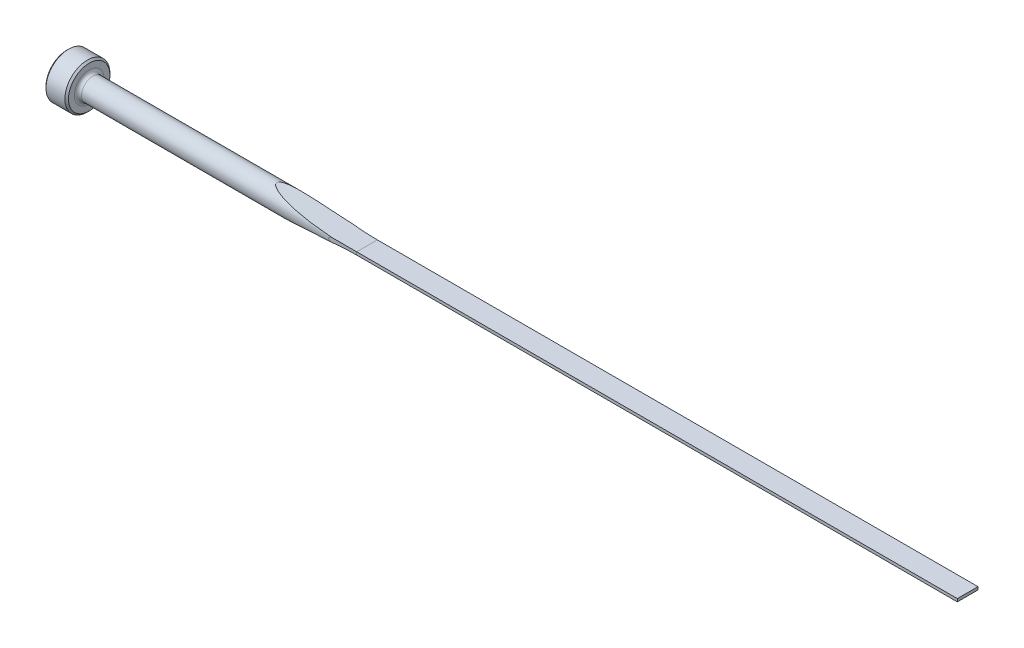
ISO-10303-21;
HEADER;
FILE_DESCRIPTION(('STEP AP214'),'2;1');
FILE_NAME('part.step','',(''),(''),'','','');
FILE_SCHEMA(('AUTOMOTIVE_DESIGN { 1 0 10303 214 1 1 1 1 }'));
ENDSEC;
DATA;
#1=APPLICATION_CONTEXT('core data for automotive mechanical design processes');
#2=APPLICATION_PROTOCOL_DEFINITION('international standard','automotive_design',2000,#1);
#3=PRODUCT_CONTEXT('',#1,'mechanical');
#4=PRODUCT('Part','Part','',(#3));
#5=PRODUCT_RELATED_PRODUCT_CATEGORY('part','',(#4));
#6=PRODUCT_DEFINITION_FORMATION('','',#4);
#7=PRODUCT_DEFINITION_CONTEXT('part definition',#1,'design');
#8=PRODUCT_DEFINITION('design','',#6,#7);
#9=PRODUCT_DEFINITION_SHAPE('','',#8);
#10=(LENGTH_UNIT() NAMED_UNIT(*) SI_UNIT(.MILLI.,.METRE.));
#11=(NAMED_UNIT(*) PLANE_ANGLE_UNIT() SI_UNIT($,.RADIAN.));
#12=(NAMED_UNIT(*) SI_UNIT($,.STERADIAN.) SOLID_ANGLE_UNIT());
#13=UNCERTAINTY_MEASURE_WITH_UNIT(LENGTH_MEASURE(1.E-05),#10,'distance_accuracy_value','');
#14=(GEOMETRIC_REPRESENTATION_CONTEXT(3) GLOBAL_UNCERTAINTY_ASSIGNED_CONTEXT((#13)) GLOBAL_UNIT_ASSIGNED_CONTEXT((#10,
#11,#12)) REPRESENTATION_CONTEXT('',''));
#15=CARTESIAN_POINT('',(0.,0.,0.));
#16=DIRECTION('',(0.,0.,1.));
#17=DIRECTION('',(1.,0.,0.));
#18=AXIS2_PLACEMENT_3D('',#15,#16,#17);
#19=CARTESIAN_POINT('',(0.,0.,0.));
#20=DIRECTION('',(-1.,0.,0.));
#21=DIRECTION('',(0.,0.,1.));
#22=AXIS2_PLACEMENT_3D('',#19,#20,#21);
#23=CYLINDRICAL_SURFACE('',#22,2.3749);
#24=CARTESIAN_POINT('',(5.5118,0.,0.));
#25=DIRECTION('',(-1.,0.,0.));
#26=DIRECTION('',(0.,0.,1.));
#27=AXIS2_PLACEMENT_3D('',#24,#25,#26);
#28=CIRCLE('',#27,2.3749);
#29=CARTESIAN_POINT('',(5.5118,0.,2.3749));
#30=VERTEX_POINT('',#29);
#31=EDGE_CURVE('E153',#30,#30,#28,.F.);
#32=ORIENTED_EDGE('',*,*,#31,.T.);
#33=EDGE_LOOP('',(#32));
#34=FACE_BOUND('',#33,.T.);
#35=CARTESIAN_POINT('',(63.5,0.931958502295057,2.18439999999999));
#36=CARTESIAN_POINT('',(63.3075515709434,0.931940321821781,2.18439976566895));
#37=CARTESIAN_POINT('',(63.1151013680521,0.930492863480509,2.18502490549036));
#38=CARTESIAN_POINT('',(62.7302234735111,0.92461137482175,2.18752450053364));
#39=CARTESIAN_POINT('',(62.5377957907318,0.920176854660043,2.18939916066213));
#40=CARTESIAN_POINT('',(62.1518341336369,0.908155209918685,2.19441218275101));
#41=CARTESIAN_POINT('',(61.9583008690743,0.900548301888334,2.19755847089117));
#42=CARTESIAN_POINT('',(61.5714442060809,0.881895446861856,2.20511052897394));
#43=CARTESIAN_POINT('',(61.3781207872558,0.870849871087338,2.20951616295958));
#44=CARTESIAN_POINT('',(60.9803005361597,0.844100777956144,2.21987943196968));
#45=CARTESIAN_POINT('',(60.7758212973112,0.828159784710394,2.2259136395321));
#46=CARTESIAN_POINT('',(60.3673129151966,0.791030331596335,2.23937732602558));
#47=CARTESIAN_POINT('',(60.1632839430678,0.769840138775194,2.24680726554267));
#48=CARTESIAN_POINT('',(59.75661740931,0.720830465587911,2.26301546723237));
#49=CARTESIAN_POINT('',(59.5539775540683,0.693029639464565,2.27178991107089));
#50=CARTESIAN_POINT('',(59.2512709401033,0.644172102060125,2.28592867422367));
#51=CARTESIAN_POINT('',(59.150603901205,0.626699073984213,2.29080303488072));
#52=CARTESIAN_POINT('',(58.9498678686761,0.588702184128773,2.30086330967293));
#53=CARTESIAN_POINT('',(58.8497987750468,0.568178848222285,2.30604917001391));
#54=CARTESIAN_POINT('',(58.7018199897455,0.534634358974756,2.31396676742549));
#55=CARTESIAN_POINT('',(58.6535509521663,0.523182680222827,2.3165891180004));
#56=CARTESIAN_POINT('',(58.5573085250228,0.499097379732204,2.32189592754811));
#57=CARTESIAN_POINT('',(58.5093351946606,0.486463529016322,2.32458039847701));
#58=CARTESIAN_POINT('',(58.3663526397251,0.446582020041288,2.33269738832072));
#59=CARTESIAN_POINT('',(58.2718724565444,0.417265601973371,2.33821536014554));
#60=CARTESIAN_POINT('',(58.1453639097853,0.370835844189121,2.34580058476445));
#61=CARTESIAN_POINT('',(58.1118331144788,0.357819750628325,2.34783049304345));
#62=CARTESIAN_POINT('',(58.0453758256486,0.330089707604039,2.35189084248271));
#63=CARTESIAN_POINT('',(58.01245087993,0.315371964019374,2.35392127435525));
#64=CARTESIAN_POINT('',(57.9466649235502,0.28318239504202,2.35801388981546));
#65=CARTESIAN_POINT('',(57.9138393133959,0.265637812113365,2.36007502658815));
#66=CARTESIAN_POINT('',(57.8503018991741,0.227094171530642,2.36409846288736));
#67=CARTESIAN_POINT('',(57.8195817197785,0.206110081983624,2.36606114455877));
#68=CARTESIAN_POINT('',(57.7807522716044,0.17363214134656,2.36855971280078));
#69=CARTESIAN_POINT('',(57.7706531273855,0.164553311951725,2.36921145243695));
#70=CARTESIAN_POINT('',(57.751335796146,0.145453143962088,2.3704611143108));
#71=CARTESIAN_POINT('',(57.7421190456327,0.135430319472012,2.3710589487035));
#72=CARTESIAN_POINT('',(57.7248924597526,0.114162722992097,2.372178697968));
#73=CARTESIAN_POINT('',(57.7168989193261,0.10290439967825,2.3726995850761));
#74=CARTESIAN_POINT('',(57.7029630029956,0.0791761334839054,2.37360916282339));
#75=CARTESIAN_POINT('',(57.6970130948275,0.0667108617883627,2.37399833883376));
#76=CARTESIAN_POINT('',(57.6895493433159,0.0451214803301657,2.37448695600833));
#77=CARTESIAN_POINT('',(57.687216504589,0.0362843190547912,2.37463982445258));
#78=CARTESIAN_POINT('',(57.684070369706,0.018342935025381,2.3748460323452));
#79=CARTESIAN_POINT('',(57.68325542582,0.00923901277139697,2.37489947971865));
#80=CARTESIAN_POINT('',(57.6832396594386,-0.00898512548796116,2.37490051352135));
#81=CARTESIAN_POINT('',(57.6840414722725,-0.0181053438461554,2.37484792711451));
#82=CARTESIAN_POINT('',(57.6871682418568,-0.0360804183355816,2.37464298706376));
#83=CARTESIAN_POINT('',(57.6894948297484,-0.0449349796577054,2.37449052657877));
#84=CARTESIAN_POINT('',(57.696426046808,-0.0650505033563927,2.37403676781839));
#85=CARTESIAN_POINT('',(57.7015301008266,-0.0761364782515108,2.37370288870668));
#86=CARTESIAN_POINT('',(57.7134090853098,-0.0973644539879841,2.37292722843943));
#87=CARTESIAN_POINT('',(57.720188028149,-0.10750410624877,2.37248518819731));
#88=CARTESIAN_POINT('',(57.7406526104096,-0.134467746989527,2.37115359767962));
#89=CARTESIAN_POINT('',(57.7555945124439,-0.150320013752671,2.37018436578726));
#90=CARTESIAN_POINT('',(57.7874630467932,-0.179846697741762,2.36812651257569));
#91=CARTESIAN_POINT('',(57.8043958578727,-0.193514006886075,2.36703752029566));
#92=CARTESIAN_POINT('',(57.8500057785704,-0.226993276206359,2.36411848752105));
#93=CARTESIAN_POINT('',(57.8796018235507,-0.245533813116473,2.36223795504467));
#94=CARTESIAN_POINT('',(57.9403493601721,-0.279898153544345,2.3584104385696));
#95=CARTESIAN_POINT('',(57.9715045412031,-0.295715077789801,2.35646330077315));
#96=CARTESIAN_POINT('',(58.0666093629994,-0.34041895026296,2.35057165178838));
#97=CARTESIAN_POINT('',(58.1319170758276,-0.366382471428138,2.34659497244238));
#98=CARTESIAN_POINT('',(58.2741782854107,-0.417382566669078,2.3380950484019));
#99=CARTESIAN_POINT('',(58.3513848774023,-0.441669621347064,2.33358126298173));
#100=CARTESIAN_POINT('',(58.506961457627,-0.486276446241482,2.32469268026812));
#101=CARTESIAN_POINT('',(58.5853319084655,-0.506594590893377,2.32031794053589));
#102=CARTESIAN_POINT('',(58.8218439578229,-0.563416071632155,2.30743335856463));
#103=CARTESIAN_POINT('',(58.9810064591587,-0.595665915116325,2.29918591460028));
#104=CARTESIAN_POINT('',(59.3005735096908,-0.653182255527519,2.28349651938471));
#105=CARTESIAN_POINT('',(59.46097818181,-0.678448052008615,2.27605464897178));
#106=CARTESIAN_POINT('',(59.7823165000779,-0.723854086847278,2.26202300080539));
#107=CARTESIAN_POINT('',(59.9432491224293,-0.744001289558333,2.25543207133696));
#108=CARTESIAN_POINT('',(60.3686966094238,-0.792003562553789,2.23917011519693));
#109=CARTESIAN_POINT('',(60.6336093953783,-0.816543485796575,2.23022625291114));
#110=CARTESIAN_POINT('',(61.1642384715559,-0.857758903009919,2.21469349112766));
#111=CARTESIAN_POINT('',(61.4299551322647,-0.874429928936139,2.20810593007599));
#112=CARTESIAN_POINT('',(61.9612705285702,-0.901186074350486,2.19732116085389));
#113=CARTESIAN_POINT('',(62.2268685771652,-0.911283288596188,2.19311956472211));
#114=CARTESIAN_POINT('',(62.7582486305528,-0.925643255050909,2.18709742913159));
#115=CARTESIAN_POINT('',(63.0240306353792,-0.929906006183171,2.18527689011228));
#116=CARTESIAN_POINT('',(63.3598826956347,-0.931763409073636,2.18448280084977));
#117=CARTESIAN_POINT('',(63.4299416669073,-0.931956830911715,2.18439997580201));
#118=CARTESIAN_POINT('',(63.5,-0.931958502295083,2.18439999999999));
#119=B_SPLINE_CURVE_WITH_KNOTS('',3,(#35,#36,#37,#38,#39,#40,#41,#42,#43,#44,#45,#46,#47,#48,
#49,#50,#51,#52,#53,#54,#55,#56,#57,#58,#59,#60,#61,#62,#63,#64,#65,#66,#67,#68,#69,#70,#71,#72,
#73,#74,#75,#76,#77,#78,#79,#80,#81,#82,#83,#84,#85,#86,#87,#88,#89,#90,#91,#92,#93,#94,#95,#96,
#97,#98,#99,#100,#101,#102,#103,#104,#105,#106,#107,#108,#109,#110,#111,#112,#113,#114,#115,
#116,#117,#118),.UNSPECIFIED.,.F.,.F.,(4,2,2,2,2,2,2,2,2,2,2,2,2,2,2,2,2,2,2,2,2,2,2,2,2,2,2,2,
2,2,2,2,2,2,2,2,2,2,2,2,2,4),(0.,0.577341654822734,1.15477801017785,1.73587049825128,
2.31690027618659,2.93240275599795,3.5481087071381,4.16209742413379,4.46893047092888,
4.77571068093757,4.9247288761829,5.07377599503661,5.37061535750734,5.47866452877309,
5.58695943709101,5.69870175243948,5.80997010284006,5.85071283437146,5.89152080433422,
5.93283229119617,5.97398983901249,6.00129967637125,6.02857985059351,6.05590452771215,
6.08325848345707,6.11967760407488,6.1561848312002,6.22123367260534,6.28649000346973,
6.39114062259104,6.49605180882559,6.70686384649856,6.94992813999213,7.19309177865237,
7.68061293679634,8.16818297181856,8.65508602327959,9.45349626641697,10.2523593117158,
11.0497483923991,11.8471376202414,12.0573140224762),.UNSPECIFIED.);
#120=CARTESIAN_POINT('',(58.3878429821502,0.451907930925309,2.33150793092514));
#121=VERTEX_POINT('',#120);
#122=CARTESIAN_POINT('',(58.3878429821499,-0.451907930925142,2.33150793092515));
#123=VERTEX_POINT('',#122);
#124=EDGE_CURVE('E156',#121,#123,#119,.T.);
#125=ORIENTED_EDGE('',*,*,#124,.F.);
#126=CARTESIAN_POINT('',(63.5,0.304800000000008,2.3552594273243));
#127=CARTESIAN_POINT('',(63.1043460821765,0.30479981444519,2.35523986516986));
#128=CARTESIAN_POINT('',(62.7086919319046,0.307441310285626,2.35491687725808));
#129=CARTESIAN_POINT('',(61.9174446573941,0.318006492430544,2.35352395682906));
#130=CARTESIAN_POINT('',(61.5218515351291,0.325930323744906,2.35245400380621));
#131=CARTESIAN_POINT('',(60.7301090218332,0.347077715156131,2.34942436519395));
#132=CARTESIAN_POINT('',(60.3339598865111,0.360310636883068,2.34746310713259));
#133=CARTESIAN_POINT('',(59.5418908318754,0.392073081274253,2.34236831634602));
#134=CARTESIAN_POINT('',(59.1459709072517,0.410602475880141,2.33923481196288));
#135=CARTESIAN_POINT('',(58.3536440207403,0.452995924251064,2.33139660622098));
#136=CARTESIAN_POINT('',(57.9572376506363,0.476870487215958,2.32668880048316));
#137=CARTESIAN_POINT('',(57.1648101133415,0.529927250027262,2.31518133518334));
#138=CARTESIAN_POINT('',(56.7687889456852,0.559109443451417,2.3083816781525));
#139=CARTESIAN_POINT('',(55.9771109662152,0.622782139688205,2.29202399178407));
#140=CARTESIAN_POINT('',(55.5814542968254,0.657274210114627,2.28246514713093));
#141=CARTESIAN_POINT('',(54.7907436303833,0.731546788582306,2.2597563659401));
#142=CARTESIAN_POINT('',(54.3956896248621,0.771327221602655,2.24660648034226));
#143=CARTESIAN_POINT('',(53.6065699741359,0.856130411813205,2.21567787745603));
#144=CARTESIAN_POINT('',(53.2125038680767,0.901149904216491,2.19790203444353));
#145=CARTESIAN_POINT('',(52.4253211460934,0.996417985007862,2.15638736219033));
#146=CARTESIAN_POINT('',(52.032204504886,1.04666643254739,2.13264869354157));
#147=CARTESIAN_POINT('',(51.2473997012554,1.15231293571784,2.07746885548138));
#148=CARTESIAN_POINT('',(50.8557109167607,1.20770837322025,2.04603158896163));
#149=CARTESIAN_POINT('',(50.0740456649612,1.32357457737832,1.97307361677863));
#150=CARTESIAN_POINT('',(49.6840689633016,1.38404462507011,1.93155433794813));
#151=CARTESIAN_POINT('',(49.0617780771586,1.48476947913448,1.85414726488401));
#152=CARTESIAN_POINT('',(48.8286677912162,1.52345842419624,1.82262717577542));
#153=CARTESIAN_POINT('',(48.3635793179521,1.60254888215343,1.75349899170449));
#154=CARTESIAN_POINT('',(48.1316013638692,1.64295073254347,1.71588969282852));
#155=CARTESIAN_POINT('',(47.6695574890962,1.72530469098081,1.63305871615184));
#156=CARTESIAN_POINT('',(47.4394896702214,1.76725495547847,1.58784587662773));
#157=CARTESIAN_POINT('',(46.981834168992,1.85255741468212,1.48746848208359));
#158=CARTESIAN_POINT('',(46.7542454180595,1.89590897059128,1.43230841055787));
#159=CARTESIAN_POINT('',(46.4156420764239,1.96176014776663,1.33905824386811));
#160=CARTESIAN_POINT('',(46.3031177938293,1.98387213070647,1.30618204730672));
#161=CARTESIAN_POINT('',(46.0793889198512,2.02828190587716,1.23610433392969));
#162=CARTESIAN_POINT('',(45.9681849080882,2.05057977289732,1.19890098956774));
#163=CARTESIAN_POINT('',(45.7474074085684,2.09528167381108,1.11894993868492));
#164=CARTESIAN_POINT('',(45.6378397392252,2.11768582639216,1.07618610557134));
#165=CARTESIAN_POINT('',(45.4217547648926,2.16228644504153,0.9835316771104));
#166=CARTESIAN_POINT('',(45.3152344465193,2.18448310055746,0.933648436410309));
#167=CARTESIAN_POINT('',(45.1586915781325,2.21739108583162,0.851003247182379));
#168=CARTESIAN_POINT('',(45.1067635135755,2.22835732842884,0.821963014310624));
#169=CARTESIAN_POINT('',(45.0047412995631,2.24999498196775,0.760743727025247));
#170=CARTESIAN_POINT('',(44.9546461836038,2.26066654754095,0.728566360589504));
#171=CARTESIAN_POINT('',(44.8573480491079,2.28147753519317,0.660507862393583));
#172=CARTESIAN_POINT('',(44.8101295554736,2.2916197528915,0.624649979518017));
#173=CARTESIAN_POINT('',(44.7196633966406,2.31112312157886,0.548106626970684));
#174=CARTESIAN_POINT('',(44.6764068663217,2.32048601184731,0.507432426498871));
#175=CARTESIAN_POINT('',(44.6062136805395,2.33572729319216,0.430865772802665));
#176=CARTESIAN_POINT('',(44.5778982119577,2.34189216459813,0.396313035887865));
#177=CARTESIAN_POINT('',(44.5265926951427,2.35308441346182,0.323266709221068));
#178=CARTESIAN_POINT('',(44.5035899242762,2.35811450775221,0.284782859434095));
#179=CARTESIAN_POINT('',(44.4711419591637,2.36521943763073,0.216084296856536));
#180=CARTESIAN_POINT('',(44.4597000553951,2.36772806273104,0.186869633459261));
#181=CARTESIAN_POINT('',(44.4416131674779,2.37169583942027,0.12691552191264));
#182=CARTESIAN_POINT('',(44.4349625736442,2.37315621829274,0.0961779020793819));
#183=CARTESIAN_POINT('',(44.427175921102,2.37486622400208,0.0337564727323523));
#184=CARTESIAN_POINT('',(44.4260753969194,2.37510804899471,0.00206786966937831));
#185=CARTESIAN_POINT('',(44.429632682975,2.37432670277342,-0.060971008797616));
#186=CARTESIAN_POINT('',(44.4342926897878,2.37330304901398,-0.0923211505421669));
#187=CARTESIAN_POINT('',(44.4482136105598,2.37024766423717,-0.151260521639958));
#188=CARTESIAN_POINT('',(44.4570801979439,2.36830234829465,-0.178950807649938));
#189=CARTESIAN_POINT('',(44.4784550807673,2.3636176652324,-0.232793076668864));
#190=CARTESIAN_POINT('',(44.4909645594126,2.36087804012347,-0.258944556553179));
#191=CARTESIAN_POINT('',(44.5297695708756,2.35239073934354,-0.329357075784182));
#192=CARTESIAN_POINT('',(44.559198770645,2.34596549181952,-0.371798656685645));
#193=CARTESIAN_POINT('',(44.6238677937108,2.33188857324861,-0.451779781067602));
#194=CARTESIAN_POINT('',(44.6591289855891,2.32423239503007,-0.489300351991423));
#195=CARTESIAN_POINT('',(44.7426941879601,2.30614793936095,-0.569123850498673));
#196=CARTESIAN_POINT('',(44.7920498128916,2.29550635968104,-0.610261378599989));
#197=CARTESIAN_POINT('',(44.8943955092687,2.27353842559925,-0.687594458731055));
#198=CARTESIAN_POINT('',(44.947392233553,2.26221082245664,-0.723780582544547));
#199=CARTESIAN_POINT('',(45.0560143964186,2.23910277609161,-0.792390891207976));
#200=CARTESIAN_POINT('',(45.1116512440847,2.22732041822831,-0.824796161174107));
#201=CARTESIAN_POINT('',(45.2245432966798,2.20352981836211,-0.886392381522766));
#202=CARTESIAN_POINT('',(45.281797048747,2.19152178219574,-0.915586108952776));
#203=CARTESIAN_POINT('',(45.439316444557,2.15865100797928,-0.991529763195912));
#204=CARTESIAN_POINT('',(45.5407803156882,2.13765710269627,-1.03573028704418));
#205=CARTESIAN_POINT('',(45.7460136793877,2.09557562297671,-1.11841472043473));
#206=CARTESIAN_POINT('',(45.8497845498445,2.07448799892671,-1.15689510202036));
#207=CARTESIAN_POINT('',(46.0591070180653,2.03234636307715,-1.22942247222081));
#208=CARTESIAN_POINT('',(46.1646618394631,2.01129250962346,-1.26346017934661));
#209=CARTESIAN_POINT('',(46.3769205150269,1.96936077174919,-1.3278714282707));
#210=CARTESIAN_POINT('',(46.4836244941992,1.9484829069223,-1.35824456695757));
#211=CARTESIAN_POINT('',(46.6981321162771,1.90692374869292,-1.41600119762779));
#212=CARTESIAN_POINT('',(46.8059376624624,1.88624298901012,-1.4433779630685));
#213=CARTESIAN_POINT('',(47.0222331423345,1.84516790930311,-1.49552876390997));
#214=CARTESIAN_POINT('',(47.1307231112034,1.82477360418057,-1.52030266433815));
#215=CARTESIAN_POINT('',(47.3480985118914,1.78433166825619,-1.56757025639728));
#216=CARTESIAN_POINT('',(47.4569831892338,1.76428359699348,-1.5900670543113));
#217=CARTESIAN_POINT('',(47.675196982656,1.72452844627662,-1.63309762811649));
#218=CARTESIAN_POINT('',(47.7845260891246,1.70482135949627,-1.65363144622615));
#219=CARTESIAN_POINT('',(48.1111425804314,1.64658117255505,-1.71229386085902));
#220=CARTESIAN_POINT('',(48.3289797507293,1.60857175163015,-1.7478914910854));
#221=CARTESIAN_POINT('',(48.7657364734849,1.53404903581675,-1.81364394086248));
#222=CARTESIAN_POINT('',(48.9846561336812,1.49753589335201,-1.84379820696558));
#223=CARTESIAN_POINT('',(49.4233891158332,1.42605291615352,-1.89962649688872));
#224=CARTESIAN_POINT('',(49.6432027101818,1.39108359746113,-1.92529903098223));
#225=CARTESIAN_POINT('',(50.0834870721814,1.32273799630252,-1.97287649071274));
#226=CARTESIAN_POINT('',(50.3039578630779,1.28936177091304,-1.99478128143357));
#227=CARTESIAN_POINT('',(50.9669325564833,1.19155095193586,-2.05579768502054));
#228=CARTESIAN_POINT('',(51.4102407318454,1.12955778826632,-2.09011926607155));
#229=CARTESIAN_POINT('',(52.2982476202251,1.01221904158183,-2.1493844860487));
#230=CARTESIAN_POINT('',(52.7429460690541,0.956872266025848,-2.17432980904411));
#231=CARTESIAN_POINT('',(53.6332648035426,0.852899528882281,-2.21717632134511));
#232=CARTESIAN_POINT('',(54.0788846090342,0.804270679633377,-2.23508054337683));
#233=CARTESIAN_POINT('',(54.9710014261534,0.713742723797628,-2.26561221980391));
#234=CARTESIAN_POINT('',(55.417498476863,0.671843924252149,-2.27823943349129));
#235=CARTESIAN_POINT('',(56.3107886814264,0.5948341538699,-2.29954678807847));
#236=CARTESIAN_POINT('',(56.7575812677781,0.559717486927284,-2.30823024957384));
#237=CARTESIAN_POINT('',(57.6516796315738,0.496243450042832,-2.32270340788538));
#238=CARTESIAN_POINT('',(58.0989853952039,0.467885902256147,-2.32849318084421));
#239=CARTESIAN_POINT('',(58.9592742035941,0.4198759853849,-2.33760615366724));
#240=CARTESIAN_POINT('',(59.3722275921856,0.399718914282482,-2.34108587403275));
#241=CARTESIAN_POINT('',(60.1984402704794,0.365165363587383,-2.34672300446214));
#242=CARTESIAN_POINT('',(60.6116995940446,0.350769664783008,-2.34888023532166));
#243=CARTESIAN_POINT('',(61.4374541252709,0.327771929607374,-2.35220275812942));
#244=CARTESIAN_POINT('',(61.849948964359,0.319156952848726,-2.35337026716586));
#245=CARTESIAN_POINT('',(62.6749626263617,0.307671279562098,-2.35488699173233));
#246=CARTESIAN_POINT('',(63.0874814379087,0.30479978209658,-2.35523632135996));
#247=CARTESIAN_POINT('',(63.5,0.304799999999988,-2.3552594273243));
#248=B_SPLINE_CURVE_WITH_KNOTS('',3,(#126,#127,#128,#129,#130,#131,#132,#133,#134,#135,#136,
#137,#138,#139,#140,#141,#142,#143,#144,#145,#146,#147,#148,#149,#150,#151,#152,#153,#154,#155,
#156,#157,#158,#159,#160,#161,#162,#163,#164,#165,#166,#167,#168,#169,#170,#171,#172,#173,#174,
#175,#176,#177,#178,#179,#180,#181,#182,#183,#184,#185,#186,#187,#188,#189,#190,#191,#192,#193,
#194,#195,#196,#197,#198,#199,#200,#201,#202,#203,#204,#205,#206,#207,#208,#209,#210,#211,#212,
#213,#214,#215,#216,#217,#218,#219,#220,#221,#222,#223,#224,#225,#226,#227,#228,#229,#230,#231,
#232,#233,#234,#235,#236,#237,#238,#239,#240,#241,#242,#243,#244,#245,#246,#247),.UNSPECIFIED.,
.F.,.F.,(4,2,2,2,2,2,2,2,2,2,2,2,2,2,2,2,2,2,2,2,2,2,2,2,2,2,2,2,2,2,2,2,2,2,2,2,2,2,2,2,2,2,2,
2,2,2,2,2,2,2,2,2,2,2,2,2,2,2,2,2,4),(0.,1.18695317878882,2.37393894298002,3.56302700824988,
4.75208632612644,5.94350432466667,7.1349208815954,8.32668985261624,9.51844191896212,
10.7094552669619,11.9004365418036,13.0908152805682,14.2810256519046,14.9961362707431,
15.7113884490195,16.4258149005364,17.1399201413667,17.4977450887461,17.855721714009,
18.2147607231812,18.5734314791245,18.7548483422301,18.9361681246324,19.1164058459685,
19.2962298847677,19.4311787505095,19.5658010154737,19.6598804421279,19.7538495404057,
19.8484195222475,19.9430255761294,20.0301263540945,20.1172554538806,20.2724769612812,
20.4282803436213,20.6232118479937,20.8185095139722,21.0147457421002,21.2108109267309,
21.5484890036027,21.8863744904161,22.2249549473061,22.5635726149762,22.9029354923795,
23.2423159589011,23.5812270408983,23.9201308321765,24.5919541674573,25.2638457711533,
25.9359602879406,26.6080988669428,27.9546954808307,29.3010501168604,30.6468242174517,
31.9926596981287,33.3373598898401,34.6820246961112,35.9223614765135,37.1628662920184,
38.4005848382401,39.6381307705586),.UNSPECIFIED.);
#249=CARTESIAN_POINT('',(58.3878429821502,0.451907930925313,-2.33150793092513));
#250=VERTEX_POINT('',#249);
#251=EDGE_CURVE('E106',#121,#250,#248,.T.);
#252=ORIENTED_EDGE('',*,*,#251,.T.);
#253=CARTESIAN_POINT('',(63.5,0.931958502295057,-2.18439999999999));
#254=CARTESIAN_POINT('',(63.3075515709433,0.931940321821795,-2.18439976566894));
#255=CARTESIAN_POINT('',(63.115101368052,0.930492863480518,-2.18502490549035));
#256=CARTESIAN_POINT('',(62.7302234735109,0.924611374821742,-2.18752450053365));
#257=CARTESIAN_POINT('',(62.5377957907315,0.920176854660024,-2.18939916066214));
#258=CARTESIAN_POINT('',(62.1518341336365,0.908155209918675,-2.19441218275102));
#259=CARTESIAN_POINT('',(61.9583008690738,0.900548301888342,-2.19755847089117));
#260=CARTESIAN_POINT('',(61.5714442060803,0.881895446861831,-2.20511052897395));
#261=CARTESIAN_POINT('',(61.3781207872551,0.870849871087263,-2.20951616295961));
#262=CARTESIAN_POINT('',(60.980300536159,0.844100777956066,-2.21987943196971));
#263=CARTESIAN_POINT('',(60.7758212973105,0.828159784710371,-2.22591363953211));
#264=CARTESIAN_POINT('',(60.3673129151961,0.791030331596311,-2.23937732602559));
#265=CARTESIAN_POINT('',(60.1632839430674,0.769840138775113,-2.2468072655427));
#266=CARTESIAN_POINT('',(59.7566174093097,0.720830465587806,-2.26301546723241));
#267=CARTESIAN_POINT('',(59.5539775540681,0.693029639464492,-2.27178991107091));
#268=CARTESIAN_POINT('',(59.2512709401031,0.644172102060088,-2.28592867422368));
#269=CARTESIAN_POINT('',(59.1506039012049,0.626699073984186,-2.29080303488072));
#270=CARTESIAN_POINT('',(58.949867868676,0.588702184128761,-2.30086330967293));
#271=CARTESIAN_POINT('',(58.8497987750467,0.568178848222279,-2.30604917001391));
#272=CARTESIAN_POINT('',(58.7018199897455,0.534634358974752,-2.31396676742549));
#273=CARTESIAN_POINT('',(58.6535509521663,0.523182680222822,-2.31658911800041));
#274=CARTESIAN_POINT('',(58.5573085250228,0.499097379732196,-2.32189592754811));
#275=CARTESIAN_POINT('',(58.5093351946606,0.486463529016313,-2.32458039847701));
#276=CARTESIAN_POINT('',(58.3663526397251,0.446582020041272,-2.33269738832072));
#277=CARTESIAN_POINT('',(58.2718724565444,0.417265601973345,-2.33821536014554));
#278=CARTESIAN_POINT('',(58.1453639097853,0.370835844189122,-2.34580058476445));
#279=CARTESIAN_POINT('',(58.1118331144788,0.357819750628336,-2.34783049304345));
#280=CARTESIAN_POINT('',(58.0453758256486,0.330089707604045,-2.35189084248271));
#281=CARTESIAN_POINT('',(58.01245087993,0.315371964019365,-2.35392127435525));
#282=CARTESIAN_POINT('',(57.9466649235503,0.28318239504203,-2.35801388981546));
#283=CARTESIAN_POINT('',(57.9138393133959,0.265637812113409,-2.36007502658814));
#284=CARTESIAN_POINT('',(57.8503018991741,0.227094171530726,-2.36409846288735));
#285=CARTESIAN_POINT('',(57.8195817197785,0.206110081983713,-2.36606114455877));
#286=CARTESIAN_POINT('',(57.7807522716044,0.173632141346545,-2.36855971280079));
#287=CARTESIAN_POINT('',(57.7706531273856,0.164553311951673,-2.36921145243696));
#288=CARTESIAN_POINT('',(57.751335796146,0.145453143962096,-2.3704611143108));
#289=CARTESIAN_POINT('',(57.7421190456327,0.135430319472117,-2.37105894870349));
#290=CARTESIAN_POINT('',(57.7248924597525,0.114162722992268,-2.37217869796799));
#291=CARTESIAN_POINT('',(57.716898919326,0.102904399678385,-2.37269958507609));
#292=CARTESIAN_POINT('',(57.7029630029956,0.0791761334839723,-2.37360916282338));
#293=CARTESIAN_POINT('',(57.6970130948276,0.0667108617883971,-2.37399833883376));
#294=CARTESIAN_POINT('',(57.6895493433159,0.0451214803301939,-2.37448695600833));
#295=CARTESIAN_POINT('',(57.6872165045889,0.0362843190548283,-2.37463982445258));
#296=CARTESIAN_POINT('',(57.684070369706,0.0183429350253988,-2.3748460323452));
#297=CARTESIAN_POINT('',(57.6832554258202,0.00923901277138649,-2.37489947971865));
#298=CARTESIAN_POINT('',(57.6832396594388,-0.00898512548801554,-2.37490051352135));
#299=CARTESIAN_POINT('',(57.6840414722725,-0.0181053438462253,-2.37484792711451));
#300=CARTESIAN_POINT('',(57.6871682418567,-0.0360804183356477,-2.37464298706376));
#301=CARTESIAN_POINT('',(57.6894948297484,-0.0449349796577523,-2.37449052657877));
#302=CARTESIAN_POINT('',(57.6964260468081,-0.0650505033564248,-2.37403676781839));
#303=CARTESIAN_POINT('',(57.7015301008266,-0.0761364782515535,-2.37370288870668));
#304=CARTESIAN_POINT('',(57.7134090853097,-0.0973644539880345,-2.37292722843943));
#305=CARTESIAN_POINT('',(57.720188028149,-0.107504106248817,-2.3724851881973));
#306=CARTESIAN_POINT('',(57.7406526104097,-0.134467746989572,-2.37115359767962));
#307=CARTESIAN_POINT('',(57.755594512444,-0.15032001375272,-2.37018436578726));
#308=CARTESIAN_POINT('',(57.7874630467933,-0.179846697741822,-2.36812651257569));
#309=CARTESIAN_POINT('',(57.8043958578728,-0.193514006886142,-2.36703752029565));
#310=CARTESIAN_POINT('',(57.8500057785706,-0.226993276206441,-2.36411848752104));
#311=CARTESIAN_POINT('',(57.8796018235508,-0.245533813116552,-2.36223795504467));
#312=CARTESIAN_POINT('',(57.9403493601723,-0.279898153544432,-2.35841043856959));
#313=CARTESIAN_POINT('',(57.9715045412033,-0.295715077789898,-2.35646330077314));
#314=CARTESIAN_POINT('',(58.0666093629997,-0.340418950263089,-2.35057165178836));
#315=CARTESIAN_POINT('',(58.1319170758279,-0.36638247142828,-2.34659497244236));
#316=CARTESIAN_POINT('',(58.2741782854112,-0.41738256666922,-2.33809504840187));
#317=CARTESIAN_POINT('',(58.3513848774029,-0.441669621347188,-2.33358126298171));
#318=CARTESIAN_POINT('',(58.5069614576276,-0.486276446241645,-2.32469268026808));
#319=CARTESIAN_POINT('',(58.5853319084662,-0.506594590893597,-2.32031794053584));
#320=CARTESIAN_POINT('',(58.8218439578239,-0.563416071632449,-2.30743335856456));
#321=CARTESIAN_POINT('',(58.9810064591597,-0.595665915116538,-2.29918591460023));
#322=CARTESIAN_POINT('',(59.3005735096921,-0.653182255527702,-2.28349651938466));
#323=CARTESIAN_POINT('',(59.4609781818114,-0.678448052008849,-2.27605464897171));
#324=CARTESIAN_POINT('',(59.7823165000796,-0.723854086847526,-2.26202300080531));
#325=CARTESIAN_POINT('',(59.9432491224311,-0.744001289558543,-2.25543207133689));
#326=CARTESIAN_POINT('',(60.3686966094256,-0.792003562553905,-2.23917011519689));
#327=CARTESIAN_POINT('',(60.6336093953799,-0.816543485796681,-2.2302262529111));
#328=CARTESIAN_POINT('',(61.1642384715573,-0.857758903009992,-2.21469349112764));
#329=CARTESIAN_POINT('',(61.4299551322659,-0.874429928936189,-2.20810593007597));
#330=CARTESIAN_POINT('',(61.9612705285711,-0.901186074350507,-2.19732116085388));
#331=CARTESIAN_POINT('',(62.226868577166,-0.911283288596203,-2.1931195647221));
#332=CARTESIAN_POINT('',(62.7582486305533,-0.925643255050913,-2.18709742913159));
#333=CARTESIAN_POINT('',(63.0240306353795,-0.929906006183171,-2.18527689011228));
#334=CARTESIAN_POINT('',(63.3598826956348,-0.931763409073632,-2.18448280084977));
#335=CARTESIAN_POINT('',(63.4299416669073,-0.931956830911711,-2.18439997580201));
#336=CARTESIAN_POINT('',(63.5,-0.931958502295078,-2.18439999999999));
#337=B_SPLINE_CURVE_WITH_KNOTS('',3,(#253,#254,#255,#256,#257,#258,#259,#260,#261,#262,#263,
#264,#265,#266,#267,#268,#269,#270,#271,#272,#273,#274,#275,#276,#277,#278,#279,#280,#281,#282,
#283,#284,#285,#286,#287,#288,#289,#290,#291,#292,#293,#294,#295,#296,#297,#298,#299,#300,#301,
#302,#303,#304,#305,#306,#307,#308,#309,#310,#311,#312,#313,#314,#315,#316,#317,#318,#319,#320,
#321,#322,#323,#324,#325,#326,#327,#328,#329,#330,#331,#332,#333,#334,#335,#336),.UNSPECIFIED.,
.F.,.F.,(4,2,2,2,2,2,2,2,2,2,2,2,2,2,2,2,2,2,2,2,2,2,2,2,2,2,2,2,2,2,2,2,2,2,2,2,2,2,2,2,2,4),
(0.,0.577341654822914,1.15477801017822,1.73587049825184,2.31690027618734,2.9324027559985,
3.54810870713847,4.16209742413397,4.46893047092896,4.77571068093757,4.92472887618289,
5.0737759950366,5.37061535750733,5.47866452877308,5.58695943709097,5.69870175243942,
5.80997010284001,5.85071283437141,5.89152080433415,5.93283229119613,5.97398983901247,
6.00129967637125,6.02857985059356,6.05590452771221,6.08325848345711,6.11967760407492,
6.15618483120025,6.22123367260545,6.28649000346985,6.39114062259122,6.49605180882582,
6.70686384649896,6.94992813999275,7.19309177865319,7.68061293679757,8.16818297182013,
8.65508602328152,9.45349626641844,10.2523593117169,11.0497483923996,11.8471376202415,
12.0573140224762),.UNSPECIFIED.);
#338=CARTESIAN_POINT('',(58.3878429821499,-0.451907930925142,-2.33150793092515));
#339=VERTEX_POINT('',#338);
#340=EDGE_CURVE('E175',#250,#339,#337,.T.);
#341=ORIENTED_EDGE('',*,*,#340,.T.);
#342=CARTESIAN_POINT('',(63.5,-0.304800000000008,2.3552594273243));
#343=CARTESIAN_POINT('',(63.1043460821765,-0.304799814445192,2.35523986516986));
#344=CARTESIAN_POINT('',(62.7086919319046,-0.307441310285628,2.35491687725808));
#345=CARTESIAN_POINT('',(61.9174446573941,-0.318006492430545,2.35352395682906));
#346=CARTESIAN_POINT('',(61.5218515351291,-0.325930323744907,2.35245400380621));
#347=CARTESIAN_POINT('',(60.7301090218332,-0.347077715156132,2.34942436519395));
#348=CARTESIAN_POINT('',(60.3339598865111,-0.360310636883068,2.34746310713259));
#349=CARTESIAN_POINT('',(59.5418908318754,-0.392073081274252,2.34236831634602));
#350=CARTESIAN_POINT('',(59.1459709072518,-0.410602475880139,2.33923481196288));
#351=CARTESIAN_POINT('',(58.3536440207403,-0.452995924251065,2.33139660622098));
#352=CARTESIAN_POINT('',(57.9572376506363,-0.476870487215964,2.32668880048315));
#353=CARTESIAN_POINT('',(57.1648101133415,-0.529927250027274,2.31518133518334));
#354=CARTESIAN_POINT('',(56.7687889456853,-0.559109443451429,2.30838167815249));
#355=CARTESIAN_POINT('',(55.9771109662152,-0.622782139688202,2.29202399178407));
#356=CARTESIAN_POINT('',(55.5814542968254,-0.657274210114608,2.28246514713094));
#357=CARTESIAN_POINT('',(54.7907436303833,-0.731546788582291,2.25975636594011));
#358=CARTESIAN_POINT('',(54.3956896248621,-0.771327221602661,2.24660648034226));
#359=CARTESIAN_POINT('',(53.606569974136,-0.856130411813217,2.21567787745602));
#360=CARTESIAN_POINT('',(53.2125038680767,-0.901149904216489,2.19790203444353));
#361=CARTESIAN_POINT('',(52.4253211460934,-0.996417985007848,2.15638736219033));
#362=CARTESIAN_POINT('',(52.032204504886,-1.04666643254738,2.13264869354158));
#363=CARTESIAN_POINT('',(51.2473997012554,-1.15231293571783,2.07746885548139));
#364=CARTESIAN_POINT('',(50.8557109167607,-1.20770837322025,2.04603158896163));
#365=CARTESIAN_POINT('',(50.0740456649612,-1.32357457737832,1.97307361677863));
#366=CARTESIAN_POINT('',(49.6840689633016,-1.38404462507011,1.93155433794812));
#367=CARTESIAN_POINT('',(49.0617780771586,-1.48476947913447,1.85414726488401));
#368=CARTESIAN_POINT('',(48.8286677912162,-1.52345842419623,1.82262717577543));
#369=CARTESIAN_POINT('',(48.3635793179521,-1.60254888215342,1.7534989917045));
#370=CARTESIAN_POINT('',(48.1316013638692,-1.64295073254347,1.71588969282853));
#371=CARTESIAN_POINT('',(47.6695574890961,-1.72530469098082,1.63305871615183));
#372=CARTESIAN_POINT('',(47.4394896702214,-1.76725495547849,1.58784587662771));
#373=CARTESIAN_POINT('',(46.981834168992,-1.85255741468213,1.48746848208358));
#374=CARTESIAN_POINT('',(46.7542454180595,-1.89590897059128,1.43230841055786));
#375=CARTESIAN_POINT('',(46.4156420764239,-1.96176014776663,1.3390582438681));
#376=CARTESIAN_POINT('',(46.3031177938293,-1.98387213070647,1.3061820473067));
#377=CARTESIAN_POINT('',(46.0793889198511,-2.02828190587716,1.23610433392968));
#378=CARTESIAN_POINT('',(45.9681849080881,-2.05057977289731,1.19890098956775));
#379=CARTESIAN_POINT('',(45.7474074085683,-2.09528167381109,1.11894993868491));
#380=CARTESIAN_POINT('',(45.6378397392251,-2.11768582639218,1.0761861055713));
#381=CARTESIAN_POINT('',(45.4217547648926,-2.16228644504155,0.983531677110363));
#382=CARTESIAN_POINT('',(45.3152344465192,-2.18448310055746,0.933648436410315));
#383=CARTESIAN_POINT('',(45.1586915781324,-2.21739108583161,0.8510032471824));
#384=CARTESIAN_POINT('',(45.1067635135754,-2.22835732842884,0.821963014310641));
#385=CARTESIAN_POINT('',(45.004741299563,-2.24999498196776,0.760743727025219));
#386=CARTESIAN_POINT('',(44.9546461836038,-2.26066654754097,0.728566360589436));
#387=CARTESIAN_POINT('',(44.8573480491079,-2.28147753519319,0.660507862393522));
#388=CARTESIAN_POINT('',(44.8101295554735,-2.2916197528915,0.624649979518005));
#389=CARTESIAN_POINT('',(44.7196633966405,-2.31112312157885,0.548106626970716));
#390=CARTESIAN_POINT('',(44.6764068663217,-2.32048601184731,0.5074324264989));
#391=CARTESIAN_POINT('',(44.6062136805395,-2.33572729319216,0.43086577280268));
#392=CARTESIAN_POINT('',(44.5778982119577,-2.34189216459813,0.396313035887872));
#393=CARTESIAN_POINT('',(44.5265926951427,-2.35308441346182,0.323266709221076));
#394=CARTESIAN_POINT('',(44.5035899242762,-2.35811450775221,0.284782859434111));
#395=CARTESIAN_POINT('',(44.4711419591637,-2.36521943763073,0.216084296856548));
#396=CARTESIAN_POINT('',(44.4597000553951,-2.36772806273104,0.186869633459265));
#397=CARTESIAN_POINT('',(44.4416131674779,-2.37169583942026,0.126915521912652));
#398=CARTESIAN_POINT('',(44.4349625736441,-2.37315621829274,0.0961779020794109));
#399=CARTESIAN_POINT('',(44.4271759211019,-2.37486622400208,0.0337564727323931));
#400=CARTESIAN_POINT('',(44.4260753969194,-2.37510804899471,0.00206786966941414));
#401=CARTESIAN_POINT('',(44.429632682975,-2.37432670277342,-0.0609710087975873));
#402=CARTESIAN_POINT('',(44.4342926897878,-2.37330304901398,-0.0923211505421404));
#403=CARTESIAN_POINT('',(44.4482136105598,-2.37024766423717,-0.151260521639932));
#404=CARTESIAN_POINT('',(44.4570801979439,-2.36830234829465,-0.178950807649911));
#405=CARTESIAN_POINT('',(44.4784550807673,-2.3636176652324,-0.232793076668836));
#406=CARTESIAN_POINT('',(44.4909645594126,-2.36087804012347,-0.258944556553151));
#407=CARTESIAN_POINT('',(44.5297695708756,-2.35239073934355,-0.329357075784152));
#408=CARTESIAN_POINT('',(44.559198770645,-2.34596549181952,-0.371798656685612));
#409=CARTESIAN_POINT('',(44.6238677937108,-2.33188857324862,-0.451779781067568));
#410=CARTESIAN_POINT('',(44.6591289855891,-2.32423239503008,-0.489300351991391));
#411=CARTESIAN_POINT('',(44.7426941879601,-2.30614793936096,-0.569123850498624));
#412=CARTESIAN_POINT('',(44.7920498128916,-2.29550635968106,-0.610261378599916));
#413=CARTESIAN_POINT('',(44.8943955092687,-2.27353842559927,-0.687594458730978));
#414=CARTESIAN_POINT('',(44.947392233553,-2.26221082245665,-0.72378058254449));
#415=CARTESIAN_POINT('',(45.0560143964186,-2.23910277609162,-0.792390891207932));
#416=CARTESIAN_POINT('',(45.1116512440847,-2.22732041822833,-0.824796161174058));
#417=CARTESIAN_POINT('',(45.2245432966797,-2.20352981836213,-0.886392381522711));
#418=CARTESIAN_POINT('',(45.2817970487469,-2.19152178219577,-0.915586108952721));
#419=CARTESIAN_POINT('',(45.4393164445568,-2.1586510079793,-0.991529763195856));
#420=CARTESIAN_POINT('',(45.540780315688,-2.1376571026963,-1.03573028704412));
#421=CARTESIAN_POINT('',(45.7460136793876,-2.09557562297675,-1.11841472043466));
#422=CARTESIAN_POINT('',(45.8497845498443,-2.07448799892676,-1.15689510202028));
#423=CARTESIAN_POINT('',(46.0591070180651,-2.0323463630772,-1.22942247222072));
#424=CARTESIAN_POINT('',(46.1646618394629,-2.01129250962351,-1.26346017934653));
#425=CARTESIAN_POINT('',(46.3769205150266,-1.96936077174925,-1.32787142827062));
#426=CARTESIAN_POINT('',(46.483624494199,-1.94848290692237,-1.35824456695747));
#427=CARTESIAN_POINT('',(46.6981321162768,-1.906923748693,-1.41600119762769));
#428=CARTESIAN_POINT('',(46.805937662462,-1.88624298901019,-1.44337796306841));
#429=CARTESIAN_POINT('',(47.0222331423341,-1.84516790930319,-1.49552876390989));
#430=CARTESIAN_POINT('',(47.130723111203,-1.82477360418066,-1.52030266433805));
#431=CARTESIAN_POINT('',(47.348098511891,-1.78433166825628,-1.56757025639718));
#432=CARTESIAN_POINT('',(47.4569831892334,-1.76428359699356,-1.59006705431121));
#433=CARTESIAN_POINT('',(47.6751969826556,-1.7245284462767,-1.63309762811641));
#434=CARTESIAN_POINT('',(47.7845260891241,-1.70482135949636,-1.65363144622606));
#435=CARTESIAN_POINT('',(48.1111425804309,-1.64658117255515,-1.71229386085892));
#436=CARTESIAN_POINT('',(48.3289797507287,-1.60857175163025,-1.7478914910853));
#437=CARTESIAN_POINT('',(48.7657364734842,-1.53404903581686,-1.81364394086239));
#438=CARTESIAN_POINT('',(48.9846561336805,-1.49753589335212,-1.8437982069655));
#439=CARTESIAN_POINT('',(49.4233891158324,-1.42605291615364,-1.89962649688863));
#440=CARTESIAN_POINT('',(49.643202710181,-1.39108359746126,-1.92529903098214));
#441=CARTESIAN_POINT('',(50.0834870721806,-1.32273799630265,-1.97287649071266));
#442=CARTESIAN_POINT('',(50.303957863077,-1.28936177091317,-1.99478128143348));
#443=CARTESIAN_POINT('',(50.9669325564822,-1.19155095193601,-2.05579768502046));
#444=CARTESIAN_POINT('',(51.4102407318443,-1.12955778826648,-2.09011926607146));
#445=CARTESIAN_POINT('',(52.2982476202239,-1.01221904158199,-2.14938448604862));
#446=CARTESIAN_POINT('',(52.7429460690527,-0.956872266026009,-2.17432980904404));
#447=CARTESIAN_POINT('',(53.6332648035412,-0.852899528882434,-2.21717632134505));
#448=CARTESIAN_POINT('',(54.0788846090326,-0.804270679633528,-2.23508054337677));
#449=CARTESIAN_POINT('',(54.9710014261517,-0.713742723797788,-2.26561221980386));
#450=CARTESIAN_POINT('',(55.4174984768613,-0.67184392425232,-2.27823943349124));
#451=CARTESIAN_POINT('',(56.3107886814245,-0.594834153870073,-2.29954678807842));
#452=CARTESIAN_POINT('',(56.7575812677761,-0.559717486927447,-2.3082302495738));
#453=CARTESIAN_POINT('',(57.6516796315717,-0.496243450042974,-2.32270340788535));
#454=CARTESIAN_POINT('',(58.0989853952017,-0.467885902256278,-2.32849318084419));
#455=CARTESIAN_POINT('',(58.959274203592,-0.419875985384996,-2.33760615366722));
#456=CARTESIAN_POINT('',(59.3722275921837,-0.399718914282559,-2.34108587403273));
#457=CARTESIAN_POINT('',(60.1984402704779,-0.365165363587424,-2.34672300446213));
#458=CARTESIAN_POINT('',(60.6116995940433,-0.350769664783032,-2.34888023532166));
#459=CARTESIAN_POINT('',(61.43745412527,-0.327771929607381,-2.35220275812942));
#460=CARTESIAN_POINT('',(61.8499489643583,-0.319156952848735,-2.35337026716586));
#461=CARTESIAN_POINT('',(62.6749626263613,-0.30767127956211,-2.35488699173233));
#462=CARTESIAN_POINT('',(63.0874814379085,-0.304799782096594,-2.35523632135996));
#463=CARTESIAN_POINT('',(63.5,-0.304799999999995,-2.3552594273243));
#464=B_SPLINE_CURVE_WITH_KNOTS('',3,(#342,#343,#344,#345,#346,#347,#348,#349,#350,#351,#352,
#353,#354,#355,#356,#357,#358,#359,#360,#361,#362,#363,#364,#365,#366,#367,#368,#369,#370,#371,
#372,#373,#374,#375,#376,#377,#378,#379,#380,#381,#382,#383,#384,#385,#386,#387,#388,#389,#390,
#391,#392,#393,#394,#395,#396,#397,#398,#399,#400,#401,#402,#403,#404,#405,#406,#407,#408,#409,
#410,#411,#412,#413,#414,#415,#416,#417,#418,#419,#420,#421,#422,#423,#424,#425,#426,#427,#428,
#429,#430,#431,#432,#433,#434,#435,#436,#437,#438,#439,#440,#441,#442,#443,#444,#445,#446,#447,
#448,#449,#450,#451,#452,#453,#454,#455,#456,#457,#458,#459,#460,#461,#462,#463),.UNSPECIFIED.,
.F.,.F.,(4,2,2,2,2,2,2,2,2,2,2,2,2,2,2,2,2,2,2,2,2,2,2,2,2,2,2,2,2,2,2,2,2,2,2,2,2,2,2,2,2,2,2,
2,2,2,2,2,2,2,2,2,2,2,2,2,2,2,2,2,4),(0.,1.18695317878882,2.37393894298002,3.56302700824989,
4.75208632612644,5.94350432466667,7.1349208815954,8.32668985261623,9.5184419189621,
10.7094552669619,11.9004365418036,13.0908152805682,14.2810256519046,14.9961362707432,
15.7113884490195,16.4258149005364,17.1399201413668,17.4977450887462,17.855721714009,
18.2147607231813,18.5734314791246,18.7548483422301,18.9361681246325,19.1164058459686,
19.2962298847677,19.4311787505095,19.5658010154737,19.6598804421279,19.7538495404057,
19.8484195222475,19.9430255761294,20.0301263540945,20.1172554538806,20.2724769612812,
20.4282803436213,20.6232118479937,20.8185095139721,21.0147457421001,21.2108109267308,
21.5484890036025,21.8863744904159,22.2249549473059,22.5635726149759,22.9029354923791,
23.2423159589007,23.5812270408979,23.9201308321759,24.5919541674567,25.2638457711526,
25.9359602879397,26.6080988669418,27.9546954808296,29.301050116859,30.6468242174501,
31.9926596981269,33.3373598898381,34.6820246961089,35.9223614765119,37.1628662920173,
38.4005848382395,39.6381307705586),.UNSPECIFIED.);
#465=EDGE_CURVE('E105',#123,#339,#464,.T.);
#466=ORIENTED_EDGE('',*,*,#465,.F.);
#467=EDGE_LOOP('',(#125,#252,#341,#466));
#468=FACE_BOUND('',#467,.T.);
#469=ADVANCED_FACE('F33',(#34,#468),#23,.T.);
#470=CARTESIAN_POINT('',(190.5,2.3749,0.));
#471=DIRECTION('',(-1.,0.,0.));
#472=DIRECTION('',(0.,0.,1.));
#473=AXIS2_PLACEMENT_3D('',#470,#471,#472);
#474=PLANE('',#473);
#475=DIRECTION('',(0.,1.,0.));
#476=VECTOR('',#475,1.);
#477=CARTESIAN_POINT('',(190.5,-4.7625,2.1844));
#478=LINE('',#477,#476);
#479=CARTESIAN_POINT('',(190.5,-0.304800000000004,2.1844));
#480=VERTEX_POINT('',#479);
#481=CARTESIAN_POINT('',(190.5,0.304800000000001,2.1844));
#482=VERTEX_POINT('',#481);
#483=EDGE_CURVE('E87',#480,#482,#478,.T.);
#484=ORIENTED_EDGE('',*,*,#483,.F.);
#485=DIRECTION('',(0.,0.,1.));
#486=VECTOR('',#485,1.);
#487=CARTESIAN_POINT('',(190.5,-0.304800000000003,0.));
#488=LINE('',#487,#486);
#489=CARTESIAN_POINT('',(190.5,-0.304800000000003,-2.1844));
#490=VERTEX_POINT('',#489);
#491=EDGE_CURVE('E100',#490,#480,#488,.T.);
#492=ORIENTED_EDGE('',*,*,#491,.F.);
#493=DIRECTION('',(0.,1.,0.));
#494=VECTOR('',#493,1.);
#495=CARTESIAN_POINT('',(190.5,-4.7625,-2.1844));
#496=LINE('',#495,#494);
#497=CARTESIAN_POINT('',(190.5,0.304799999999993,-2.1844));
#498=VERTEX_POINT('',#497);
#499=EDGE_CURVE('E56',#490,#498,#496,.T.);
#500=ORIENTED_EDGE('',*,*,#499,.T.);
#501=DIRECTION('',(0.,0.,1.));
#502=VECTOR('',#501,1.);
#503=CARTESIAN_POINT('',(190.5,0.304800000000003,0.));
#504=LINE('',#503,#502);
#505=EDGE_CURVE('E102',#498,#482,#504,.T.);
#506=ORIENTED_EDGE('',*,*,#505,.T.);
#507=EDGE_LOOP('',(#484,#492,#500,#506));
#508=FACE_BOUND('',#507,.T.);
#509=ADVANCED_FACE('F99',(#508),#474,.F.);
#510=CARTESIAN_POINT('',(63.5,89.2048,-4.7625));
#511=DIRECTION('',(0.,0.,1.));
#512=DIRECTION('',(1.,0.,0.));
#513=AXIS2_PLACEMENT_3D('',#510,#511,#512);
#514=CYLINDRICAL_SURFACE('',#513,88.9);
#515=CARTESIAN_POINT('',(63.5,89.2048,91.0844));
#516=DIRECTION('',(0.,-0.707106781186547,0.707106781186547));
#517=DIRECTION('',(0.,0.707106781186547,0.707106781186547));
#518=AXIS2_PLACEMENT_3D('',#515,#516,#517);
#519=ELLIPSE('',#518,125.723585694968,88.9);
#520=CARTESIAN_POINT('',(63.5,0.304799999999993,2.18439999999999));
#521=VERTEX_POINT('',#520);
#522=EDGE_CURVE('E162',#521,#121,#519,.F.);
#523=ORIENTED_EDGE('',*,*,#522,.F.);
#524=DIRECTION('',(0.,0.,1.));
#525=VECTOR('',#524,1.);
#526=CARTESIAN_POINT('',(63.5,0.304799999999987,-4.7625));
#527=LINE('',#526,#525);
#528=CARTESIAN_POINT('',(63.5,0.304799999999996,-2.18439999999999));
#529=VERTEX_POINT('',#528);
#530=EDGE_CURVE('E170',#529,#521,#527,.T.);
#531=ORIENTED_EDGE('',*,*,#530,.F.);
#532=CARTESIAN_POINT('',(63.5,89.2048,-91.0844));
#533=DIRECTION('',(0.,0.707106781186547,0.707106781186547));
#534=DIRECTION('',(0.,-0.707106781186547,0.707106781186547));
#535=AXIS2_PLACEMENT_3D('',#532,#533,#534);
#536=ELLIPSE('',#535,125.723585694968,88.9);
#537=EDGE_CURVE('E169',#529,#250,#536,.F.);
#538=ORIENTED_EDGE('',*,*,#537,.T.);
#539=ORIENTED_EDGE('',*,*,#251,.F.);
#540=EDGE_LOOP('',(#523,#531,#538,#539));
#541=FACE_BOUND('',#540,.T.);
#542=ADVANCED_FACE('F138',(#541),#514,.F.);
#543=CARTESIAN_POINT('',(190.5,0.304800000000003,-4.7625));
#544=DIRECTION('',(0.,-1.,0.));
#545=DIRECTION('',(1.,0.,0.));
#546=AXIS2_PLACEMENT_3D('',#543,#544,#545);
#547=PLANE('',#546);
#548=DIRECTION('',(-1.,0.,0.));
#549=VECTOR('',#548,1.);
#550=CARTESIAN_POINT('',(190.5,0.304800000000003,2.1844));
#551=LINE('',#550,#549);
#552=EDGE_CURVE('E188',#482,#521,#551,.T.);
#553=ORIENTED_EDGE('',*,*,#552,.F.);
#554=ORIENTED_EDGE('',*,*,#505,.F.);
#555=DIRECTION('',(-1.,0.,0.));
#556=VECTOR('',#555,1.);
#557=CARTESIAN_POINT('',(190.5,0.304800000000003,-2.1844));
#558=LINE('',#557,#556);
#559=EDGE_CURVE('E174',#498,#529,#558,.T.);
#560=ORIENTED_EDGE('',*,*,#559,.T.);
#561=ORIENTED_EDGE('',*,*,#530,.T.);
#562=EDGE_LOOP('',(#553,#554,#560,#561));
#563=FACE_BOUND('',#562,.T.);
#564=ADVANCED_FACE('F129',(#563),#547,.F.);
#565=CARTESIAN_POINT('',(63.5,-89.2048,-4.7625));
#566=DIRECTION('',(0.,0.,1.));
#567=DIRECTION('',(1.,0.,0.));
#568=AXIS2_PLACEMENT_3D('',#565,#566,#567);
#569=CYLINDRICAL_SURFACE('',#568,88.9);
#570=DIRECTION('',(0.,0.,1.));
#571=VECTOR('',#570,1.);
#572=CARTESIAN_POINT('',(63.5,-0.304799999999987,-4.7625));
#573=LINE('',#572,#571);
#574=CARTESIAN_POINT('',(63.5,-0.304800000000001,-2.18439999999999));
#575=VERTEX_POINT('',#574);
#576=CARTESIAN_POINT('',(63.5,-0.304799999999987,2.18439999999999));
#577=VERTEX_POINT('',#576);
#578=EDGE_CURVE('E178',#575,#577,#573,.T.);
#579=ORIENTED_EDGE('',*,*,#578,.T.);
#580=CARTESIAN_POINT('',(63.5,-89.2048,91.0844));
#581=DIRECTION('',(0.,0.707106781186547,0.707106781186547));
#582=DIRECTION('',(0.,-0.707106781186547,0.707106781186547));
#583=AXIS2_PLACEMENT_3D('',#580,#581,#582);
#584=ELLIPSE('',#583,125.723585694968,88.9);
#585=EDGE_CURVE('E163',#577,#123,#584,.T.);
#586=ORIENTED_EDGE('',*,*,#585,.T.);
#587=ORIENTED_EDGE('',*,*,#465,.T.);
#588=CARTESIAN_POINT('',(63.5,-89.2048,-91.0844));
#589=DIRECTION('',(0.,-0.707106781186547,0.707106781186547));
#590=DIRECTION('',(0.,0.707106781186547,0.707106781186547));
#591=AXIS2_PLACEMENT_3D('',#588,#589,#590);
#592=ELLIPSE('',#591,125.723585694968,88.9);
#593=EDGE_CURVE('E180',#575,#339,#592,.T.);
#594=ORIENTED_EDGE('',*,*,#593,.F.);
#595=EDGE_LOOP('',(#579,#586,#587,#594));
#596=FACE_BOUND('',#595,.T.);
#597=ADVANCED_FACE('F124',(#596),#569,.F.);
#598=CARTESIAN_POINT('',(190.5,-0.304800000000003,-4.7625));
#599=DIRECTION('',(0.,-1.,0.));
#600=DIRECTION('',(1.,0.,0.));
#601=AXIS2_PLACEMENT_3D('',#598,#599,#600);
#602=PLANE('',#601);
#603=ORIENTED_EDGE('',*,*,#491,.T.);
#604=DIRECTION('',(-1.,0.,0.));
#605=VECTOR('',#604,1.);
#606=CARTESIAN_POINT('',(190.5,-0.304800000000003,2.1844));
#607=LINE('',#606,#605);
#608=EDGE_CURVE('E84',#480,#577,#607,.T.);
#609=ORIENTED_EDGE('',*,*,#608,.T.);
#610=ORIENTED_EDGE('',*,*,#578,.F.);
#611=DIRECTION('',(-1.,0.,0.));
#612=VECTOR('',#611,1.);
#613=CARTESIAN_POINT('',(190.5,-0.304800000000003,-2.1844));
#614=LINE('',#613,#612);
#615=EDGE_CURVE('E94',#490,#575,#614,.T.);
#616=ORIENTED_EDGE('',*,*,#615,.F.);
#617=EDGE_LOOP('',(#603,#609,#610,#616));
#618=FACE_BOUND('',#617,.T.);
#619=ADVANCED_FACE('F104',(#618),#602,.T.);
#620=CARTESIAN_POINT('',(0.,0.,0.));
#621=DIRECTION('',(1.,0.,0.));
#622=DIRECTION('',(0.,0.,-1.));
#623=AXIS2_PLACEMENT_3D('',#620,#621,#622);
#624=PLANE('',#623);
#625=CARTESIAN_POINT('',(0.,0.,0.));
#626=DIRECTION('',(1.,0.,0.));
#627=DIRECTION('',(0.,0.,-1.));
#628=AXIS2_PLACEMENT_3D('',#625,#626,#627);
#629=CIRCLE('',#628,4.38150000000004);
#630=CARTESIAN_POINT('',(0.,0.,-4.38150000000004));
#631=VERTEX_POINT('',#630);
#632=EDGE_CURVE('E239',#631,#631,#629,.F.);
#633=ORIENTED_EDGE('',*,*,#632,.T.);
#634=EDGE_LOOP('',(#633));
#635=FACE_BOUND('',#634,.T.);
#636=ADVANCED_FACE('F136',(#635),#624,.F.);
#637=CARTESIAN_POINT('',(0.,0.,0.));
#638=DIRECTION('',(-1.,0.,0.));
#639=DIRECTION('',(0.,0.,1.));
#640=AXIS2_PLACEMENT_3D('',#637,#638,#639);
#641=CYLINDRICAL_SURFACE('',#640,4.7625);
#642=CARTESIAN_POINT('',(0.380999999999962,0.,0.));
#643=DIRECTION('',(1.,0.,0.));
#644=DIRECTION('',(0.,0.,-1.));
#645=AXIS2_PLACEMENT_3D('',#642,#643,#644);
#646=CIRCLE('',#645,4.7625);
#647=CARTESIAN_POINT('',(0.380999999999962,0.,-4.7625));
#648=VERTEX_POINT('',#647);
#649=EDGE_CURVE('E41',#648,#648,#646,.T.);
#650=ORIENTED_EDGE('',*,*,#649,.T.);
#651=EDGE_LOOP('',(#650));
#652=FACE_BOUND('',#651,.T.);
#653=CARTESIAN_POINT('',(4.36880000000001,0.,0.));
#654=DIRECTION('',(-1.,0.,0.));
#655=DIRECTION('',(0.,0.,1.));
#656=AXIS2_PLACEMENT_3D('',#653,#654,#655);
#657=CIRCLE('',#656,4.7625);
#658=CARTESIAN_POINT('',(4.36880000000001,0.,4.7625));
#659=VERTEX_POINT('',#658);
#660=EDGE_CURVE('E240',#659,#659,#657,.T.);
#661=ORIENTED_EDGE('',*,*,#660,.T.);
#662=EDGE_LOOP('',(#661));
#663=FACE_BOUND('',#662,.T.);
#664=ADVANCED_FACE('F213',(#652,#663),#641,.T.);
#665=CARTESIAN_POINT('',(4.7498,4.7625,0.));
#666=DIRECTION('',(-1.,0.,0.));
#667=DIRECTION('',(0.,0.,1.));
#668=AXIS2_PLACEMENT_3D('',#665,#666,#667);
#669=PLANE('',#668);
#670=CARTESIAN_POINT('',(4.7498,0.,0.));
#671=DIRECTION('',(-1.,0.,0.));
#672=DIRECTION('',(0.,0.,1.));
#673=AXIS2_PLACEMENT_3D('',#670,#671,#672);
#674=CIRCLE('',#673,4.38150000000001);
#675=CARTESIAN_POINT('',(4.7498,0.,4.38150000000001));
#676=VERTEX_POINT('',#675);
#677=EDGE_CURVE('E11',#676,#676,#674,.F.);
#678=ORIENTED_EDGE('',*,*,#677,.T.);
#679=EDGE_LOOP('',(#678));
#680=FACE_BOUND('',#679,.T.);
#681=CARTESIAN_POINT('',(4.7498,0.,0.));
#682=DIRECTION('',(-1.,0.,0.));
#683=DIRECTION('',(0.,0.,1.));
#684=AXIS2_PLACEMENT_3D('',#681,#682,#683);
#685=CIRCLE('',#684,3.1369);
#686=CARTESIAN_POINT('',(4.7498,0.,3.1369));
#687=VERTEX_POINT('',#686);
#688=EDGE_CURVE('E93',#687,#687,#685,.T.);
#689=ORIENTED_EDGE('',*,*,#688,.T.);
#690=EDGE_LOOP('',(#689));
#691=FACE_BOUND('',#690,.T.);
#692=ADVANCED_FACE('F208',(#680,#691),#669,.F.);
#693=CARTESIAN_POINT('',(190.5,-4.7625,-2.1844));
#694=DIRECTION('',(0.,0.,1.));
#695=DIRECTION('',(1.,0.,0.));
#696=AXIS2_PLACEMENT_3D('',#693,#694,#695);
#697=PLANE('',#696);
#698=ORIENTED_EDGE('',*,*,#499,.F.);
#699=ORIENTED_EDGE('',*,*,#615,.T.);
#700=DIRECTION('',(0.,1.,0.));
#701=VECTOR('',#700,1.);
#702=CARTESIAN_POINT('',(63.5,-4.7625,-2.18439999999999));
#703=LINE('',#702,#701);
#704=EDGE_CURVE('E190',#575,#529,#703,.T.);
#705=ORIENTED_EDGE('',*,*,#704,.T.);
#706=ORIENTED_EDGE('',*,*,#559,.F.);
#707=EDGE_LOOP('',(#698,#699,#705,#706));
#708=FACE_BOUND('',#707,.T.);
#709=ADVANCED_FACE('F189',(#708),#697,.F.);
#710=CARTESIAN_POINT('',(63.5,-4.7625,-91.0844));
#711=DIRECTION('',(0.,1.,0.));
#712=DIRECTION('',(0.,0.,1.));
#713=AXIS2_PLACEMENT_3D('',#710,#711,#712);
#714=CYLINDRICAL_SURFACE('',#713,88.9);
#715=ORIENTED_EDGE('',*,*,#704,.F.);
#716=ORIENTED_EDGE('',*,*,#593,.T.);
#717=ORIENTED_EDGE('',*,*,#340,.F.);
#718=ORIENTED_EDGE('',*,*,#537,.F.);
#719=EDGE_LOOP('',(#715,#716,#717,#718));
#720=FACE_BOUND('',#719,.T.);
#721=ADVANCED_FACE('F131',(#720),#714,.F.);
#722=CARTESIAN_POINT('',(63.5,-4.7625,91.0844));
#723=DIRECTION('',(0.,1.,0.));
#724=DIRECTION('',(0.,0.,1.));
#725=AXIS2_PLACEMENT_3D('',#722,#723,#724);
#726=CYLINDRICAL_SURFACE('',#725,88.9);
#727=ORIENTED_EDGE('',*,*,#522,.T.);
#728=ORIENTED_EDGE('',*,*,#124,.T.);
#729=ORIENTED_EDGE('',*,*,#585,.F.);
#730=DIRECTION('',(0.,1.,0.));
#731=VECTOR('',#730,1.);
#732=CARTESIAN_POINT('',(63.5,-4.7625,2.18439999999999));
#733=LINE('',#732,#731);
#734=EDGE_CURVE('E48',#577,#521,#733,.T.);
#735=ORIENTED_EDGE('',*,*,#734,.T.);
#736=EDGE_LOOP('',(#727,#728,#729,#735));
#737=FACE_BOUND('',#736,.T.);
#738=ADVANCED_FACE('F201',(#737),#726,.F.);
#739=CARTESIAN_POINT('',(190.5,-4.7625,2.1844));
#740=DIRECTION('',(0.,0.,1.));
#741=DIRECTION('',(1.,0.,0.));
#742=AXIS2_PLACEMENT_3D('',#739,#740,#741);
#743=PLANE('',#742);
#744=ORIENTED_EDGE('',*,*,#552,.T.);
#745=ORIENTED_EDGE('',*,*,#734,.F.);
#746=ORIENTED_EDGE('',*,*,#608,.F.);
#747=ORIENTED_EDGE('',*,*,#483,.T.);
#748=EDGE_LOOP('',(#744,#745,#746,#747));
#749=FACE_BOUND('',#748,.T.);
#750=ADVANCED_FACE('F86',(#749),#743,.T.);
#751=CARTESIAN_POINT('',(5.5118,0.,0.));
#752=DIRECTION('',(-1.,0.,0.));
#753=DIRECTION('',(0.,0.,1.));
#754=AXIS2_PLACEMENT_3D('',#751,#752,#753);
#755=TOROIDAL_SURFACE('',#754,3.1369,0.762);
#756=ORIENTED_EDGE('',*,*,#31,.F.);
#757=EDGE_LOOP('',(#756));
#758=FACE_BOUND('',#757,.T.);
#759=ORIENTED_EDGE('',*,*,#688,.F.);
#760=EDGE_LOOP('',(#759));
#761=FACE_BOUND('',#760,.T.);
#762=ADVANCED_FACE('F206',(#758,#761),#755,.F.);
#763=CARTESIAN_POINT('',(0.,0.,0.));
#764=DIRECTION('',(1.,0.,0.));
#765=DIRECTION('',(0.,0.,-1.));
#766=AXIS2_PLACEMENT_3D('',#763,#764,#765);
#767=CONICAL_SURFACE('',#766,4.38150000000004,0.785398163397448);
#768=ORIENTED_EDGE('',*,*,#649,.F.);
#769=EDGE_LOOP('',(#768));
#770=FACE_BOUND('',#769,.T.);
#771=ORIENTED_EDGE('',*,*,#632,.F.);
#772=EDGE_LOOP('',(#771));
#773=FACE_BOUND('',#772,.T.);
#774=ADVANCED_FACE('F226',(#770,#773),#767,.T.);
#775=CARTESIAN_POINT('',(4.36880000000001,0.,0.));
#776=DIRECTION('',(-1.,0.,0.));
#777=DIRECTION('',(0.,0.,1.));
#778=AXIS2_PLACEMENT_3D('',#775,#776,#777);
#779=CONICAL_SURFACE('',#778,4.7625,0.785398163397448);
#780=ORIENTED_EDGE('',*,*,#677,.F.);
#781=EDGE_LOOP('',(#780));
#782=FACE_BOUND('',#781,.T.);
#783=ORIENTED_EDGE('',*,*,#660,.F.);
#784=EDGE_LOOP('',(#783));
#785=FACE_BOUND('',#784,.T.);
#786=ADVANCED_FACE('F35',(#782,#785),#779,.T.);
#787=CLOSED_SHELL('',(#469,#509,#542,#564,#597,#619,#636,#664,#692,#709,#721,#738,#750,#762,
#774,#786));
#788=MANIFOLD_SOLID_BREP('B2',#787);
#789=ADVANCED_BREP_SHAPE_REPRESENTATION('',(#18,#788),#14);
#790=SHAPE_DEFINITION_REPRESENTATION(#9,#789);
ENDSEC;
END-ISO-10303-21;
